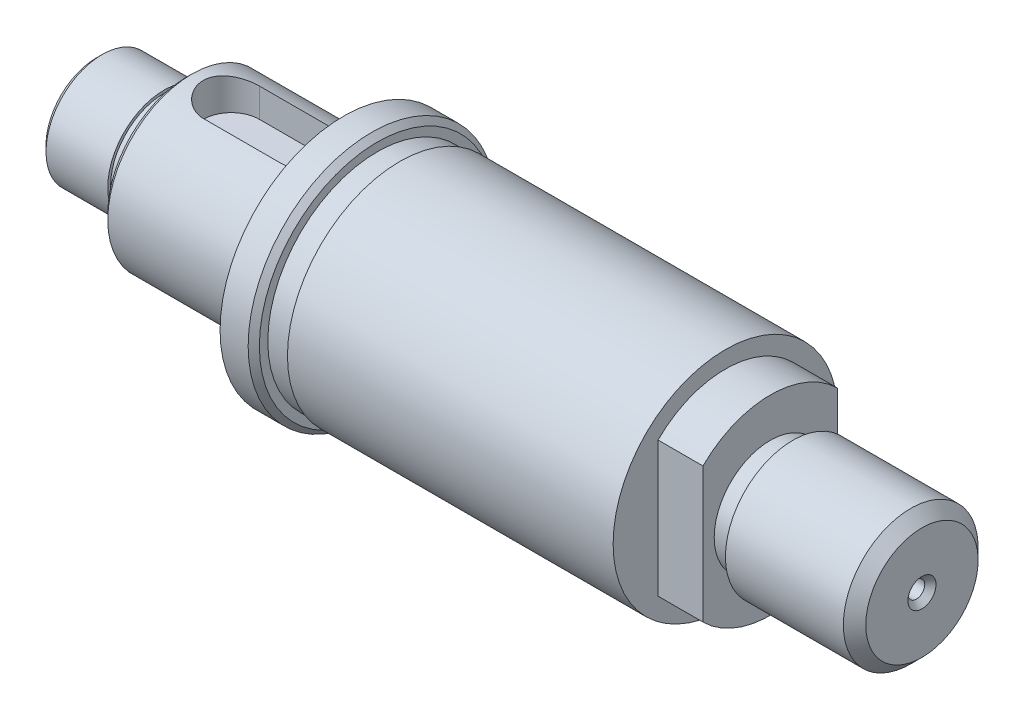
from build123d import *

# Parameters (mm, degrees)
CHANFREIN1_SIZE                     = 0.5
ENL_V_MAT_EXTRU_1_DEPTH             = 4
CHANFREIN2_SIZE                     = 1
DIAM_TRE_DU_PER_AGE_1_5_1_5_1_D     = 1.5
DIAM_TRE_DU_PER_AGE_1_5_1_5_1_DEPTH = 2
DIAM_TRE_DU_PER_AGE_1_5_1_5_1_TIP   = 0.450645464
CHANFREIN3_SIZE                     = 0.5
DIAM_TRE_DU_PER_AGE_1_5_1_5_2_D     = 1.5
DIAM_TRE_DU_PER_AGE_1_5_1_5_2_DEPTH = 2
DIAM_TRE_DU_PER_AGE_1_5_1_5_2_TIP   = 0.450645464
CHANFREIN4_SIZE                     = 0.5
ENL_V_MAT_EXTRU_2_DEPTH             = 76.917718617


with BuildPart() as part:
    # Esquisse1 → R_volution1 (revolve)
    with BuildSketch(Plane.XY, mode=Mode.PRIVATE) as r_volution1_sk:
        Polygon((0, 0), (0, 5), (6, 5), (6, 4.75), (8, 4.75), (8, 7.5), (22, 7.5), (22, 11), (25, 11), (25, 9.75), (27, 9.75), (27, 10), (56, 10), (56, 8.5), (60, 8.5), (60, 5), (62, 5), (62, 6), (73.5, 6), (73.5, 0), align=None)
    revolve(r_volution1_sk.sketch.rotate(Axis((0, 0, 0), (1, 0, 0)), 90), axis=Axis((0, 0, 0), (1, 0, 0)))

    # Chanfrein1
    chanfrein1_edges = [part.edges().sort_by_distance(p)[0] for p in [
        (25, 0, -11),
        (8, 0, -7.5),
        (8, 0, -4.75),
        (0, 0, -5),
    ]]
    chamfer(chanfrein1_edges, length=CHANFREIN1_SIZE)

    # Esquisse2 → Enl_v. mat.-Extru.1 (cut)
    with BuildSketch(Plane(origin=(60, 0, 0), x_dir=(0, 0, -1), z_dir=(1, 0, 0))):
        with BuildLine():
            Line((-6, 12.573525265), (-6, -12.573525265))
            ThreePointArc((-6, -12.573525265), (-13.931745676, 0), (-6, 12.573525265))
        make_face()
        with BuildLine():
            Line((6, 12.573525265), (6, -12.573525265))
            ThreePointArc((6, -12.573525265), (13.931745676, 0), (6, 12.573525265))
        make_face()
    extrude(amount=-ENL_V_MAT_EXTRU_1_DEPTH, mode=Mode.SUBTRACT)

    # Chanfrein2
    chanfrein2_edges = [part.edges().sort_by_distance(p)[0] for p in [
        (73.5, 0, -6),
    ]]
    chamfer(chanfrein2_edges, length=CHANFREIN2_SIZE)

    # Diam_tre du per_age _1.5 _1.5_1
    with Locations(Plane(origin=(73.5, 0, 0), x_dir=(0, 0, -1), z_dir=(1, 0, 0))):
        with Locations((0, 0)):
            Hole(DIAM_TRE_DU_PER_AGE_1_5_1_5_1_D / 2, depth=DIAM_TRE_DU_PER_AGE_1_5_1_5_1_DEPTH)
            with Locations((0, 0, -(DIAM_TRE_DU_PER_AGE_1_5_1_5_1_DEPTH + DIAM_TRE_DU_PER_AGE_1_5_1_5_1_TIP / 2))):  # 118° drill point
                Cone(0, DIAM_TRE_DU_PER_AGE_1_5_1_5_1_D / 2, DIAM_TRE_DU_PER_AGE_1_5_1_5_1_TIP, mode=Mode.SUBTRACT)

    # Chanfrein3
    chanfrein3_edges = [part.edges().sort_by_distance(p)[0] for p in [
        (73.5, 0, -0.75),
    ]]
    chamfer(chanfrein3_edges, length=CHANFREIN3_SIZE)

    # Diam_tre du per_age _1.5 _1.5_2
    with Locations(Plane.ZY):
        with Locations((0, 0)):
            Hole(DIAM_TRE_DU_PER_AGE_1_5_1_5_2_D / 2, depth=DIAM_TRE_DU_PER_AGE_1_5_1_5_2_DEPTH)
            with Locations((0, 0, -(DIAM_TRE_DU_PER_AGE_1_5_1_5_2_DEPTH + DIAM_TRE_DU_PER_AGE_1_5_1_5_2_TIP / 2))):  # 118° drill point
                Cone(0, DIAM_TRE_DU_PER_AGE_1_5_1_5_2_D / 2, DIAM_TRE_DU_PER_AGE_1_5_1_5_2_TIP, mode=Mode.SUBTRACT)

    # Chanfrein4
    chanfrein4_edges = [part.edges().sort_by_distance(p)[0] for p in [
        (0, 0, 0.75),
    ]]
    chamfer(chanfrein4_edges, length=CHANFREIN4_SIZE)

    # Esquisse7 → Enl_v. mat.-Extru.2 (cut, through all)
    with BuildSketch(Plane(origin=(0, 4.5, 0), x_dir=(-1, 0, 0), z_dir=(0, 1, 0))):
        with BuildLine():
            Line((-19, 2.5), (-12, 2.5))
            ThreePointArc((-12, 2.5), (-9.5, 0), (-12, -2.5))
            Line((-12, -2.5), (-19, -2.5))
            ThreePointArc((-19, -2.5), (-21.5, 0), (-19, 2.5))
        make_face()
    extrude(amount=ENL_V_MAT_EXTRU_2_DEPTH, mode=Mode.SUBTRACT)


solid = part.part
